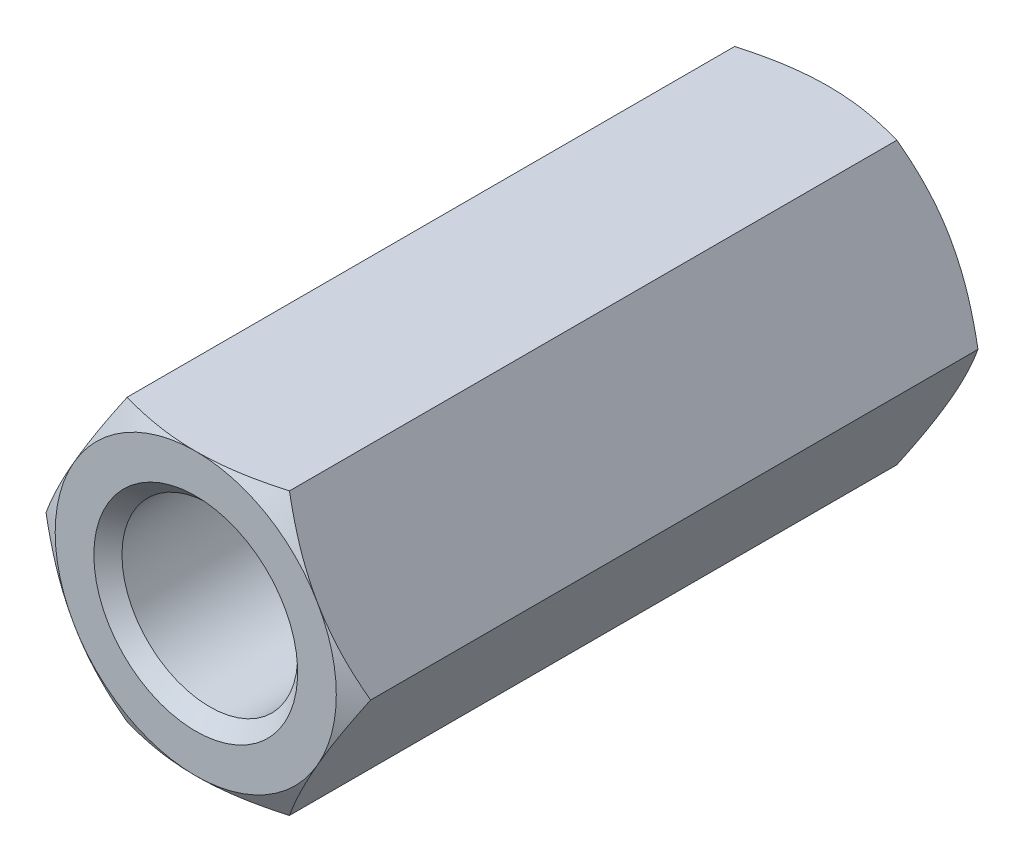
ISO-10303-21;
HEADER;
FILE_DESCRIPTION(('STEP AP214'),'2;1');
FILE_NAME('part.step','',(''),(''),'','','');
FILE_SCHEMA(('AUTOMOTIVE_DESIGN { 1 0 10303 214 1 1 1 1 }'));
ENDSEC;
DATA;
#1=APPLICATION_CONTEXT('core data for automotive mechanical design processes');
#2=APPLICATION_PROTOCOL_DEFINITION('international standard','automotive_design',2000,#1);
#3=PRODUCT_CONTEXT('',#1,'mechanical');
#4=PRODUCT('Part','Part','',(#3));
#5=PRODUCT_RELATED_PRODUCT_CATEGORY('part','',(#4));
#6=PRODUCT_DEFINITION_FORMATION('','',#4);
#7=PRODUCT_DEFINITION_CONTEXT('part definition',#1,'design');
#8=PRODUCT_DEFINITION('design','',#6,#7);
#9=PRODUCT_DEFINITION_SHAPE('','',#8);
#10=(LENGTH_UNIT() NAMED_UNIT(*) SI_UNIT(.MILLI.,.METRE.));
#11=(NAMED_UNIT(*) PLANE_ANGLE_UNIT() SI_UNIT($,.RADIAN.));
#12=(NAMED_UNIT(*) SI_UNIT($,.STERADIAN.) SOLID_ANGLE_UNIT());
#13=UNCERTAINTY_MEASURE_WITH_UNIT(LENGTH_MEASURE(1.E-05),#10,'distance_accuracy_value','');
#14=(GEOMETRIC_REPRESENTATION_CONTEXT(3) GLOBAL_UNCERTAINTY_ASSIGNED_CONTEXT((#13)) GLOBAL_UNIT_ASSIGNED_CONTEXT((#10,
#11,#12)) REPRESENTATION_CONTEXT('',''));
#15=CARTESIAN_POINT('',(0.,0.,0.));
#16=DIRECTION('',(0.,0.,1.));
#17=DIRECTION('',(1.,0.,0.));
#18=AXIS2_PLACEMENT_3D('',#15,#16,#17);
#19=CARTESIAN_POINT('',(4.61880215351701,0.,-9.));
#20=DIRECTION('',(0.866025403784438,0.5,0.));
#21=DIRECTION('',(-0.5,0.866025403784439,0.));
#22=AXIS2_PLACEMENT_3D('',#19,#20,#21);
#23=PLANE('',#22);
#24=CARTESIAN_POINT('',(4.61891762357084,-0.000199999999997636,8.64266774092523));
#25=CARTESIAN_POINT('',(4.5174314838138,0.17557915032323,8.70128212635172));
#26=CARTESIAN_POINT('',(4.41506932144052,0.352875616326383,8.75458967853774));
#27=CARTESIAN_POINT('',(4.20857250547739,0.710538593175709,8.8476383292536));
#28=CARTESIAN_POINT('',(4.10443418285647,0.890911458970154,8.8873465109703));
#29=CARTESIAN_POINT('',(3.89744813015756,1.24942181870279,8.94915778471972));
#30=CARTESIAN_POINT('',(3.79463224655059,1.42750415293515,8.97167226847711));
#31=CARTESIAN_POINT('',(3.58851671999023,1.78450671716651,8.99854937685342));
#32=CARTESIAN_POINT('',(3.48521782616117,1.9634256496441,9.00293425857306));
#33=CARTESIAN_POINT('',(3.29219970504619,2.29774284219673,8.99380992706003));
#34=CARTESIAN_POINT('',(3.20245157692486,2.45319115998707,8.982541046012));
#35=CARTESIAN_POINT('',(3.02354002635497,2.76307505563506,8.94682600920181));
#36=CARTESIAN_POINT('',(2.93437722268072,2.91750956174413,8.92236765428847));
#37=CARTESIAN_POINT('',(2.75509682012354,3.22803232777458,8.86122393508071));
#38=CARTESIAN_POINT('',(2.6650019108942,3.3840812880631,8.82427939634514));
#39=CARTESIAN_POINT('',(2.48615580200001,3.69385183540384,8.74042992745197));
#40=CARTESIAN_POINT('',(2.39740231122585,3.84757739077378,8.69354469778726));
#41=CARTESIAN_POINT('',(2.30928560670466,4.0002,8.64266774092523));
#42=B_SPLINE_CURVE_WITH_KNOTS('',3,(#24,#25,#26,#27,#28,#29,#30,#31,#32,#33,#34,#35,#36,#37,#38,
#39,#40,#41),.UNSPECIFIED.,.F.,.F.,(4,2,2,2,2,2,2,2,4),(0.,0.634047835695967,1.26961969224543,
1.88946157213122,2.50854226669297,3.04757825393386,3.58711366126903,4.13861653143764,
4.68903648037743),.UNSPECIFIED.);
#43=CARTESIAN_POINT('',(4.61880215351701,0.,8.64273441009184));
#44=VERTEX_POINT('',#43);
#45=CARTESIAN_POINT('',(3.46410161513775,2.,9.));
#46=VERTEX_POINT('',#45);
#47=EDGE_CURVE('E127',#44,#46,#42,.T.);
#48=ORIENTED_EDGE('',*,*,#47,.F.);
#49=DIRECTION('',(0.,0.,1.));
#50=VECTOR('',#49,1.);
#51=CARTESIAN_POINT('',(4.61880215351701,0.,-9.));
#52=LINE('',#51,#50);
#53=CARTESIAN_POINT('',(4.61880215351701,0.,-8.64273441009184));
#54=VERTEX_POINT('',#53);
#55=EDGE_CURVE('E540',#54,#44,#52,.T.);
#56=ORIENTED_EDGE('',*,*,#55,.F.);
#57=CARTESIAN_POINT('',(4.61891762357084,-0.000199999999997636,-8.64266774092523));
#58=CARTESIAN_POINT('',(4.5174314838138,0.17557915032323,-8.70128212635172));
#59=CARTESIAN_POINT('',(4.41506932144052,0.352875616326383,-8.75458967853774));
#60=CARTESIAN_POINT('',(4.20857250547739,0.710538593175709,-8.8476383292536));
#61=CARTESIAN_POINT('',(4.10443418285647,0.890911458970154,-8.8873465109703));
#62=CARTESIAN_POINT('',(3.89744813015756,1.24942181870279,-8.94915778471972));
#63=CARTESIAN_POINT('',(3.79463224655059,1.42750415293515,-8.97167226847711));
#64=CARTESIAN_POINT('',(3.58851671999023,1.78450671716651,-8.99854937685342));
#65=CARTESIAN_POINT('',(3.48521782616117,1.9634256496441,-9.00293425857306));
#66=CARTESIAN_POINT('',(3.29219970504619,2.29774284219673,-8.99380992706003));
#67=CARTESIAN_POINT('',(3.20245157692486,2.45319115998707,-8.982541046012));
#68=CARTESIAN_POINT('',(3.02354002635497,2.76307505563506,-8.94682600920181));
#69=CARTESIAN_POINT('',(2.93437722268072,2.91750956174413,-8.92236765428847));
#70=CARTESIAN_POINT('',(2.75509682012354,3.22803232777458,-8.86122393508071));
#71=CARTESIAN_POINT('',(2.6650019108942,3.3840812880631,-8.82427939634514));
#72=CARTESIAN_POINT('',(2.48615580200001,3.69385183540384,-8.74042992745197));
#73=CARTESIAN_POINT('',(2.39740231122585,3.84757739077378,-8.69354469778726));
#74=CARTESIAN_POINT('',(2.30928560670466,4.0002,-8.64266774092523));
#75=B_SPLINE_CURVE_WITH_KNOTS('',3,(#57,#58,#59,#60,#61,#62,#63,#64,#65,#66,#67,#68,#69,#70,#71,
#72,#73,#74),.UNSPECIFIED.,.F.,.F.,(4,2,2,2,2,2,2,2,4),(0.,0.634047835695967,1.26961969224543,
1.88946157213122,2.50854226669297,3.04757825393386,3.58711366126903,4.13861653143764,
4.68903648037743),.UNSPECIFIED.);
#76=CARTESIAN_POINT('',(3.46410161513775,2.,-9.));
#77=VERTEX_POINT('',#76);
#78=EDGE_CURVE('E629',#54,#77,#75,.T.);
#79=ORIENTED_EDGE('',*,*,#78,.T.);
#80=CARTESIAN_POINT('',(2.3094010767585,4.,-8.64273441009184));
#81=VERTEX_POINT('',#80);
#82=EDGE_CURVE('E269',#77,#81,#75,.T.);
#83=ORIENTED_EDGE('',*,*,#82,.T.);
#84=DIRECTION('',(0.,0.,1.));
#85=VECTOR('',#84,1.);
#86=CARTESIAN_POINT('',(2.3094010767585,4.,-9.));
#87=LINE('',#86,#85);
#88=CARTESIAN_POINT('',(2.3094010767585,4.,8.64273441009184));
#89=VERTEX_POINT('',#88);
#90=EDGE_CURVE('E159',#81,#89,#87,.T.);
#91=ORIENTED_EDGE('',*,*,#90,.T.);
#92=EDGE_CURVE('E140',#46,#89,#42,.T.);
#93=ORIENTED_EDGE('',*,*,#92,.F.);
#94=EDGE_LOOP('',(#48,#56,#79,#83,#91,#93));
#95=FACE_BOUND('',#94,.T.);
#96=ADVANCED_FACE('F41',(#95),#23,.T.);
#97=CARTESIAN_POINT('',(2.3094010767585,-4.,-9.));
#98=DIRECTION('',(0.866025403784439,-0.5,0.));
#99=DIRECTION('',(0.5,0.866025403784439,0.));
#100=AXIS2_PLACEMENT_3D('',#97,#98,#99);
#101=PLANE('',#100);
#102=CARTESIAN_POINT('',(2.30928560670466,-4.0002,8.64266774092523));
#103=CARTESIAN_POINT('',(2.4107717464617,-3.82442084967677,8.70128212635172));
#104=CARTESIAN_POINT('',(2.51313390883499,-3.64712438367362,8.75458967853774));
#105=CARTESIAN_POINT('',(2.71963072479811,-3.28946140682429,8.8476383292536));
#106=CARTESIAN_POINT('',(2.82376904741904,-3.10908854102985,8.8873465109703));
#107=CARTESIAN_POINT('',(3.03075510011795,-2.75057818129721,8.94915778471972));
#108=CARTESIAN_POINT('',(3.13357098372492,-2.57249584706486,8.97167226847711));
#109=CARTESIAN_POINT('',(3.33968651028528,-2.21549328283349,8.99854937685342));
#110=CARTESIAN_POINT('',(3.44298540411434,-2.0365743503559,9.00293425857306));
#111=CARTESIAN_POINT('',(3.63600352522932,-1.70225715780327,8.99380992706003));
#112=CARTESIAN_POINT('',(3.72575165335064,-1.54680884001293,8.98254104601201));
#113=CARTESIAN_POINT('',(3.90466320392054,-1.23692494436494,8.94682600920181));
#114=CARTESIAN_POINT('',(3.99382600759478,-1.08249043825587,8.92236765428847));
#115=CARTESIAN_POINT('',(4.17310641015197,-0.771967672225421,8.86122393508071));
#116=CARTESIAN_POINT('',(4.26320131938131,-0.615918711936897,8.82427939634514));
#117=CARTESIAN_POINT('',(4.4420474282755,-0.306148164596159,8.74042992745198));
#118=CARTESIAN_POINT('',(4.53080091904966,-0.152422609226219,8.69354469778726));
#119=CARTESIAN_POINT('',(4.61891762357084,0.00020000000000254,8.64266774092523));
#120=B_SPLINE_CURVE_WITH_KNOTS('',3,(#102,#103,#104,#105,#106,#107,#108,#109,#110,#111,#112,
#113,#114,#115,#116,#117,#118,#119),.UNSPECIFIED.,.F.,.F.,(4,2,2,2,2,2,2,2,4),(0.,
0.634047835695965,1.26961969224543,1.88946157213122,2.50854226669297,3.04757825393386,
3.58711366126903,4.13861653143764,4.68903648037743),.UNSPECIFIED.);
#121=CARTESIAN_POINT('',(2.3094010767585,-4.,8.64273441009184));
#122=VERTEX_POINT('',#121);
#123=CARTESIAN_POINT('',(3.46410161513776,-2.,9.));
#124=VERTEX_POINT('',#123);
#125=EDGE_CURVE('E591',#122,#124,#120,.T.);
#126=ORIENTED_EDGE('',*,*,#125,.F.);
#127=DIRECTION('',(0.,0.,1.));
#128=VECTOR('',#127,1.);
#129=CARTESIAN_POINT('',(2.3094010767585,-4.,-9.));
#130=LINE('',#129,#128);
#131=CARTESIAN_POINT('',(2.3094010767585,-4.,-8.64273441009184));
#132=VERTEX_POINT('',#131);
#133=EDGE_CURVE('E283',#132,#122,#130,.T.);
#134=ORIENTED_EDGE('',*,*,#133,.F.);
#135=CARTESIAN_POINT('',(2.30928560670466,-4.0002,-8.64266774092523));
#136=CARTESIAN_POINT('',(2.4107717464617,-3.82442084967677,-8.70128212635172));
#137=CARTESIAN_POINT('',(2.51313390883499,-3.64712438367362,-8.75458967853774));
#138=CARTESIAN_POINT('',(2.71963072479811,-3.28946140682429,-8.8476383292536));
#139=CARTESIAN_POINT('',(2.82376904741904,-3.10908854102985,-8.8873465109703));
#140=CARTESIAN_POINT('',(3.03075510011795,-2.75057818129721,-8.94915778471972));
#141=CARTESIAN_POINT('',(3.13357098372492,-2.57249584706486,-8.97167226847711));
#142=CARTESIAN_POINT('',(3.33968651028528,-2.21549328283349,-8.99854937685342));
#143=CARTESIAN_POINT('',(3.44298540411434,-2.0365743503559,-9.00293425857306));
#144=CARTESIAN_POINT('',(3.63600352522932,-1.70225715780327,-8.99380992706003));
#145=CARTESIAN_POINT('',(3.72575165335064,-1.54680884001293,-8.98254104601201));
#146=CARTESIAN_POINT('',(3.90466320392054,-1.23692494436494,-8.94682600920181));
#147=CARTESIAN_POINT('',(3.99382600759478,-1.08249043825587,-8.92236765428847));
#148=CARTESIAN_POINT('',(4.17310641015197,-0.771967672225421,-8.86122393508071));
#149=CARTESIAN_POINT('',(4.26320131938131,-0.615918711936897,-8.82427939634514));
#150=CARTESIAN_POINT('',(4.4420474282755,-0.306148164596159,-8.74042992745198));
#151=CARTESIAN_POINT('',(4.53080091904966,-0.152422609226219,-8.69354469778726));
#152=CARTESIAN_POINT('',(4.61891762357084,0.00020000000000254,-8.64266774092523));
#153=B_SPLINE_CURVE_WITH_KNOTS('',3,(#135,#136,#137,#138,#139,#140,#141,#142,#143,#144,#145,
#146,#147,#148,#149,#150,#151,#152),.UNSPECIFIED.,.F.,.F.,(4,2,2,2,2,2,2,2,4),(0.,
0.634047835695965,1.26961969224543,1.88946157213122,2.50854226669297,3.04757825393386,
3.58711366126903,4.13861653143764,4.68903648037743),.UNSPECIFIED.);
#154=CARTESIAN_POINT('',(3.46410161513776,-2.,-9.));
#155=VERTEX_POINT('',#154);
#156=EDGE_CURVE('E555',#132,#155,#153,.T.);
#157=ORIENTED_EDGE('',*,*,#156,.T.);
#158=EDGE_CURVE('E284',#155,#54,#153,.T.);
#159=ORIENTED_EDGE('',*,*,#158,.T.);
#160=ORIENTED_EDGE('',*,*,#55,.T.);
#161=EDGE_CURVE('E132',#124,#44,#120,.T.);
#162=ORIENTED_EDGE('',*,*,#161,.F.);
#163=EDGE_LOOP('',(#126,#134,#157,#159,#160,#162));
#164=FACE_BOUND('',#163,.T.);
#165=ADVANCED_FACE('F254',(#164),#101,.T.);
#166=CARTESIAN_POINT('',(-2.3094010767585,-4.,-9.));
#167=DIRECTION('',(0.,-1.,0.));
#168=DIRECTION('',(0.,0.,-1.));
#169=AXIS2_PLACEMENT_3D('',#166,#167,#168);
#170=PLANE('',#169);
#171=CARTESIAN_POINT('',(-16.4916312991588,-4.,1.51188603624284));
#172=CARTESIAN_POINT('',(-16.1312328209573,-4.,1.71409069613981));
#173=CARTESIAN_POINT('',(-15.77068382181,-4.,1.91602775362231));
#174=CARTESIAN_POINT('',(-15.049201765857,-4.,2.31921881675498));
#175=CARTESIAN_POINT('',(-14.6882687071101,-4.,2.52047281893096));
#176=CARTESIAN_POINT('',(-13.9658537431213,-4.,2.92219537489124));
#177=CARTESIAN_POINT('',(-13.6043717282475,-4.,3.12266373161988));
#178=CARTESIAN_POINT('',(-12.8808313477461,-4.,3.52255625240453));
#179=CARTESIAN_POINT('',(-12.5187729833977,-4.,3.72198041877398));
#180=CARTESIAN_POINT('',(-11.7954183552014,-4.,4.11868585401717));
#181=CARTESIAN_POINT('',(-11.4341250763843,-4.,4.31597256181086));
#182=CARTESIAN_POINT('',(-10.7106137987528,-4.,4.70884244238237));
#183=CARTESIAN_POINT('',(-10.3483958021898,-4.,4.90442561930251));
#184=CARTESIAN_POINT('',(-9.6227924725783,-4.,5.29331429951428));
#185=CARTESIAN_POINT('',(-9.25940728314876,-4.,5.48662007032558));
#186=CARTESIAN_POINT('',(-8.5310232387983,-4.,5.87016008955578));
#187=CARTESIAN_POINT('',(-8.16602440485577,-4.,6.06039437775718));
#188=CARTESIAN_POINT('',(-7.43762903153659,-4.,6.43460741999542));
#189=CARTESIAN_POINT('',(-7.07425550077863,-4.,6.61863073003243));
#190=CARTESIAN_POINT('',(-6.52687320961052,-4.,6.89007104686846));
#191=CARTESIAN_POINT('',(-6.34400823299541,-4.,6.97979355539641));
#192=CARTESIAN_POINT('',(-5.97735992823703,-4.,7.15733986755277));
#193=CARTESIAN_POINT('',(-5.79357661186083,-4.,7.24516369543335));
#194=CARTESIAN_POINT('',(-5.42381455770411,-4.,7.41897809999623));
#195=CARTESIAN_POINT('',(-5.23782926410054,-4.,7.50495476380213));
#196=CARTESIAN_POINT('',(-4.86451206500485,-4.,7.67392578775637));
#197=CARTESIAN_POINT('',(-4.67718020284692,-4.,7.75692024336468));
#198=CARTESIAN_POINT('',(-4.30091095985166,-4.,7.91911298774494));
#199=CARTESIAN_POINT('',(-4.11197386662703,-4.,7.99831194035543));
#200=CARTESIAN_POINT('',(-3.73214185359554,-4.,8.15184400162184));
#201=CARTESIAN_POINT('',(-3.54124707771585,-4.,8.22617746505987));
#202=CARTESIAN_POINT('',(-3.11243143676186,-4.,8.38512278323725));
#203=CARTESIAN_POINT('',(-2.87389730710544,-4.,8.46810545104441));
#204=CARTESIAN_POINT('',(-2.3925623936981,-4.,8.62091075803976));
#205=CARTESIAN_POINT('',(-2.14976124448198,-4.,8.6907322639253));
#206=CARTESIAN_POINT('',(-1.66248200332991,-4.,8.81165231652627));
#207=CARTESIAN_POINT('',(-1.41805966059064,-4.,8.86296698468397));
#208=CARTESIAN_POINT('',(-1.04871773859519,-4.,8.92292392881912));
#209=CARTESIAN_POINT('',(-0.92516224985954,-4.,8.94007304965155));
#210=CARTESIAN_POINT('',(-0.677355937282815,-4.,8.96817129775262));
#211=CARTESIAN_POINT('',(-0.553105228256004,-4.,8.97912141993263));
#212=CARTESIAN_POINT('',(-0.302254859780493,-4.,8.99455291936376));
#213=CARTESIAN_POINT('',(-0.175648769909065,-4.,8.99893082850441));
#214=CARTESIAN_POINT('',(0.0776131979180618,-4.,9.00072237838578));
#215=CARTESIAN_POINT('',(0.204269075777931,-4.,8.99813603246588));
#216=CARTESIAN_POINT('',(0.457267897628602,-4.,8.986099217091));
#217=CARTESIAN_POINT('',(0.583610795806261,-4.,8.97664779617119));
#218=CARTESIAN_POINT('',(0.835635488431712,-4.,8.95123191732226));
#219=CARTESIAN_POINT('',(0.961317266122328,-4.,8.93526729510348));
#220=CARTESIAN_POINT('',(1.21324172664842,-4.,8.89714078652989));
#221=CARTESIAN_POINT('',(1.33947360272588,-4.,8.87490817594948));
#222=CARTESIAN_POINT('',(1.5908473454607,-4.,8.82499230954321));
#223=CARTESIAN_POINT('',(1.71598919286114,-4.,8.79730895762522));
#224=CARTESIAN_POINT('',(1.96515481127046,-4.,8.73717674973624));
#225=CARTESIAN_POINT('',(2.08917822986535,-4.,8.70472644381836));
#226=CARTESIAN_POINT('',(2.33606506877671,-4.,8.63573069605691));
#227=CARTESIAN_POINT('',(2.45892854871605,-4.,8.59918546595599));
#228=CARTESIAN_POINT('',(2.79836139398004,-4.,8.49293320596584));
#229=CARTESIAN_POINT('',(3.0137568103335,-4.,8.4194760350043));
#230=CARTESIAN_POINT('',(3.44159224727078,-4.,8.26435823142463));
#231=CARTESIAN_POINT('',(3.6540314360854,-4.,8.18269534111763));
#232=CARTESIAN_POINT('',(4.07663527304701,-4.,8.01314779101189));
#233=CARTESIAN_POINT('',(4.28679753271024,-4.,7.92525721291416));
#234=CARTESIAN_POINT('',(4.70508199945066,-4.,7.74483049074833));
#235=CARTESIAN_POINT('',(4.91320440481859,-4.,7.65229480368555));
#236=CARTESIAN_POINT('',(5.32837622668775,-4.,7.46339746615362));
#237=CARTESIAN_POINT('',(5.53542124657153,-4.,7.36702618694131));
#238=CARTESIAN_POINT('',(5.94818704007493,-4.,7.17148597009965));
#239=CARTESIAN_POINT('',(6.15390778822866,-4.,7.07231697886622));
#240=CARTESIAN_POINT('',(6.56415611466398,-4.,6.87182573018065));
#241=CARTESIAN_POINT('',(6.76868428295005,-4.,6.77050467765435));
#242=CARTESIAN_POINT('',(7.17685446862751,-4.,6.56609136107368));
#243=CARTESIAN_POINT('',(7.38049647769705,-4.,6.46299908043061));
#244=CARTESIAN_POINT('',(7.99165611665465,-4.,6.15090841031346));
#245=CARTESIAN_POINT('',(8.39807249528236,-4.,5.93975438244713));
#246=CARTESIAN_POINT('',(9.20890655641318,-4.,5.51353970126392));
#247=CARTESIAN_POINT('',(9.61332398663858,-4.,5.29847857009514));
#248=CARTESIAN_POINT('',(10.4200598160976,-4.,4.8659205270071));
#249=CARTESIAN_POINT('',(10.8223804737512,-4.,4.64842782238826));
#250=CARTESIAN_POINT('',(11.6259229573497,-4.,4.21142176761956));
#251=CARTESIAN_POINT('',(12.0271447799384,-4.,3.9919084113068));
#252=CARTESIAN_POINT('',(12.7683222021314,-4.,3.58456647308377));
#253=CARTESIAN_POINT('',(13.108394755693,-4.,3.3969505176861));
#254=CARTESIAN_POINT('',(13.7881624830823,-4.,3.02077357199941));
#255=CARTESIAN_POINT('',(14.1278574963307,-4.,2.83221229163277));
#256=CARTESIAN_POINT('',(14.8051403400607,-4.,2.45532366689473));
#257=CARTESIAN_POINT('',(15.142730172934,-4.,2.26699991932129));
#258=CARTESIAN_POINT('',(15.8174678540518,-4.,1.88982453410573));
#259=CARTESIAN_POINT('',(16.154615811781,-4.,1.70097309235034));
#260=CARTESIAN_POINT('',(16.4916312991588,-4.,1.51188603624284));
#261=B_SPLINE_CURVE_WITH_KNOTS('',3,(#171,#172,#173,#174,#175,#176,#177,#178,#179,#180,#181,
#182,#183,#184,#185,#186,#187,#188,#189,#190,#191,#192,#193,#194,#195,#196,#197,#198,#199,#200,
#201,#202,#203,#204,#205,#206,#207,#208,#209,#210,#211,#212,#213,#214,#215,#216,#217,#218,#219,
#220,#221,#222,#223,#224,#225,#226,#227,#228,#229,#230,#231,#232,#233,#234,#235,#236,#237,#238,
#239,#240,#241,#242,#243,#244,#245,#246,#247,#248,#249,#250,#251,#252,#253,#254,#255,#256,#257,
#258,#259,#260),.UNSPECIFIED.,.F.,.F.,(4,2,2,2,2,2,2,2,2,2,2,2,2,2,2,2,2,2,2,2,2,2,2,2,2,2,2,2,
2,2,2,2,2,2,2,2,2,2,2,2,2,2,2,2,4),(0.,1.23974393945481,2.47949417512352,3.71953766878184,
4.95957841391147,6.19452184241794,7.42946226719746,8.66425615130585,9.89903402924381,
11.1209302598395,11.7319927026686,12.343047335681,12.9577156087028,13.5723641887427,
14.1869048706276,14.8014006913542,15.5587851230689,16.3162347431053,17.0645282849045,
17.4386158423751,17.8126433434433,18.1924996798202,18.5723552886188,18.9522635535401,
19.3321814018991,19.7165704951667,20.100966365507,20.4854793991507,20.8699725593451,
21.5524524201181,22.2351205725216,22.9184464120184,23.601705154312,24.2868031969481,
24.9719143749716,25.6566515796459,26.3413952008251,27.7153469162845,29.0894678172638,
30.4614964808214,31.8335293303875,32.9987066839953,34.164266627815,35.3239618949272,
36.4832723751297),.UNSPECIFIED.);
#262=CARTESIAN_POINT('',(-2.3094010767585,-4.,8.64273441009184));
#263=VERTEX_POINT('',#262);
#264=CARTESIAN_POINT('',(0.,-4.,9.));
#265=VERTEX_POINT('',#264);
#266=EDGE_CURVE('E593',#263,#265,#261,.T.);
#267=ORIENTED_EDGE('',*,*,#266,.F.);
#268=DIRECTION('',(0.,0.,1.));
#269=VECTOR('',#268,1.);
#270=CARTESIAN_POINT('',(-2.3094010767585,-4.,-9.));
#271=LINE('',#270,#269);
#272=CARTESIAN_POINT('',(-2.3094010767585,-4.,-8.64273441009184));
#273=VERTEX_POINT('',#272);
#274=EDGE_CURVE('E541',#273,#263,#271,.T.);
#275=ORIENTED_EDGE('',*,*,#274,.F.);
#276=CARTESIAN_POINT('',(-10.9193914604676,-4.,-4.59540798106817));
#277=CARTESIAN_POINT('',(-10.6754464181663,-4.,-4.72764470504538));
#278=CARTESIAN_POINT('',(-10.4312897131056,-4.,-4.85949298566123));
#279=CARTESIAN_POINT('',(-9.94244275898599,-4.,-5.12220803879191));
#280=CARTESIAN_POINT('',(-9.69775249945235,-4.,-5.25307479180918));
#281=CARTESIAN_POINT('',(-9.20754604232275,-4.,-5.51371891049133));
#282=CARTESIAN_POINT('',(-8.96202934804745,-4.,-5.64349534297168));
#283=CARTESIAN_POINT('',(-8.47021923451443,-4.,-5.90156473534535));
#284=CARTESIAN_POINT('',(-8.22392582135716,-4.,-6.02985770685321));
#285=CARTESIAN_POINT('',(-7.72178617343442,-4.,-6.2890137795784));
#286=CARTESIAN_POINT('',(-7.46590583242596,-4.,-6.41981090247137));
#287=CARTESIAN_POINT('',(-6.95284589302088,-4.,-6.67883016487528));
#288=CARTESIAN_POINT('',(-6.69566630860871,-4.,-6.80705233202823));
#289=CARTESIAN_POINT('',(-6.17972310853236,-4.,-7.06007088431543));
#290=CARTESIAN_POINT('',(-5.92096001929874,-4.,-7.18486833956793));
#291=CARTESIAN_POINT('',(-5.40129143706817,-4.,-7.42990611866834));
#292=CARTESIAN_POINT('',(-5.14038604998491,-4.,-7.55014666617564));
#293=CARTESIAN_POINT('',(-4.60388312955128,-4.,-7.78967391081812));
#294=CARTESIAN_POINT('',(-4.32815528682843,-4.,-7.9086708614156));
#295=CARTESIAN_POINT('',(-3.77255113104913,-4.,-8.13691684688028));
#296=CARTESIAN_POINT('',(-3.4926736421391,-4.,-8.24616305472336));
#297=CARTESIAN_POINT('',(-2.93037800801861,-4.,-8.44936328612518));
#298=CARTESIAN_POINT('',(-2.64801025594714,-4.,-8.54345439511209));
#299=CARTESIAN_POINT('',(-2.07717481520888,-4.,-8.71104060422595));
#300=CARTESIAN_POINT('',(-1.78871049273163,-4.,-8.78454676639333));
#301=CARTESIAN_POINT('',(-1.27903400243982,-4.,-8.88766736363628));
#302=CARTESIAN_POINT('',(-1.05915292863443,-4.,-8.92367104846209));
#303=CARTESIAN_POINT('',(-0.727634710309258,-4.,-8.96293564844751));
#304=CARTESIAN_POINT('',(-0.616850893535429,-4.,-8.97356688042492));
#305=CARTESIAN_POINT('',(-0.394912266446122,-4.,-8.98964133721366));
#306=CARTESIAN_POINT('',(-0.283757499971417,-4.,-8.99508515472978));
#307=CARTESIAN_POINT('',(-0.0614106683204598,-4.,-9.00061771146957));
#308=CARTESIAN_POINT('',(0.0497812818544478,-4.,-9.00071106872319));
#309=CARTESIAN_POINT('',(0.272039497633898,-4.,-8.99555323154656));
#310=CARTESIAN_POINT('',(0.383105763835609,-4.,-8.99030206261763));
#311=CARTESIAN_POINT('',(0.604876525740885,-4.,-8.97460892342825));
#312=CARTESIAN_POINT('',(0.715580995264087,-4.,-8.96416658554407));
#313=CARTESIAN_POINT('',(0.936422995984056,-4.,-8.93838291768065));
#314=CARTESIAN_POINT('',(1.04656045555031,-4.,-8.923040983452));
#315=CARTESIAN_POINT('',(1.36926182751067,-4.,-8.87129492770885));
#316=CARTESIAN_POINT('',(1.58083772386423,-4.,-8.8286448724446));
#317=CARTESIAN_POINT('',(2.00076058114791,-4.,-8.72959584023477));
#318=CARTESIAN_POINT('',(2.20910578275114,-4.,-8.67318963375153));
#319=CARTESIAN_POINT('',(2.62305814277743,-4.,-8.54963228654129));
#320=CARTESIAN_POINT('',(2.82865801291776,-4.,-8.48245704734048));
#321=CARTESIAN_POINT('',(3.2369703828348,-4.,-8.34002880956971));
#322=CARTESIAN_POINT('',(3.43968332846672,-4.,-8.26477707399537));
#323=CARTESIAN_POINT('',(3.84636914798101,-4.,-8.10671756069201));
#324=CARTESIAN_POINT('',(4.05029799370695,-4.,-8.0237973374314));
#325=CARTESIAN_POINT('',(4.4561142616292,-4.,-7.85311958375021));
#326=CARTESIAN_POINT('',(4.65800164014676,-4.,-7.76536195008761));
#327=CARTESIAN_POINT('',(5.05984603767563,-4.,-7.58624075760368));
#328=CARTESIAN_POINT('',(5.25980524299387,-4.,-7.49488208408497));
#329=CARTESIAN_POINT('',(5.65836621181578,-4.,-7.30926571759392));
#330=CARTESIAN_POINT('',(5.85696799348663,-4.,-7.21500806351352));
#331=CARTESIAN_POINT('',(6.2643782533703,-4.,-7.01874796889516));
#332=CARTESIAN_POINT('',(6.47312165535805,-4.,-6.91661070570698));
#333=CARTESIAN_POINT('',(6.88960080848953,-4.,-6.71029969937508));
#334=CARTESIAN_POINT('',(7.09733654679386,-4.,-6.60612593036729));
#335=CARTESIAN_POINT('',(7.7194602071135,-4.,-6.29109737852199));
#336=CARTESIAN_POINT('',(8.13261474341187,-4.,-6.07780829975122));
#337=CARTESIAN_POINT('',(8.94226579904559,-4.,-5.65443497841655));
#338=CARTESIAN_POINT('',(9.33884019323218,-4.,-5.44449892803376));
#339=CARTESIAN_POINT('',(9.93245419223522,-4.,-5.12749109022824));
#340=CARTESIAN_POINT('',(10.1300702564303,-4.,-5.02149690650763));
#341=CARTESIAN_POINT('',(10.5249683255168,-4.,-4.80889097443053));
#342=CARTESIAN_POINT('',(10.722250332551,-4.,-4.70227923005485));
#343=CARTESIAN_POINT('',(10.9193914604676,-4.,-4.59540798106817));
#344=B_SPLINE_CURVE_WITH_KNOTS('',3,(#276,#277,#278,#279,#280,#281,#282,#283,#284,#285,#286,
#287,#288,#289,#290,#291,#292,#293,#294,#295,#296,#297,#298,#299,#300,#301,#302,#303,#304,#305,
#306,#307,#308,#309,#310,#311,#312,#313,#314,#315,#316,#317,#318,#319,#320,#321,#322,#323,#324,
#325,#326,#327,#328,#329,#330,#331,#332,#333,#334,#335,#336,#337,#338,#339,#340,#341,#342,#343),
.UNSPECIFIED.,.F.,.F.,(4,2,2,2,2,2,2,2,2,2,2,2,2,2,2,2,2,2,2,2,2,2,2,2,2,2,2,2,2,2,2,2,2,4),(0.,
0.832444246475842,1.66490498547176,2.49801751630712,3.33112351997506,4.19322828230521,
5.05532378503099,5.91714676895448,6.77892739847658,7.67973160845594,8.58079614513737,
9.47318665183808,10.3650966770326,11.032702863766,11.3664759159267,11.7002108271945,
12.033657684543,12.3671029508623,12.7005718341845,13.0340818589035,13.6809363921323,
14.3281316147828,14.9767958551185,15.6253588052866,16.2857056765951,16.9460666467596,
17.6055606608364,18.2650458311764,18.96220638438,19.6593757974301,21.0542144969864,
22.4003431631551,23.0730842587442,23.7458210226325),.UNSPECIFIED.);
#345=CARTESIAN_POINT('',(0.,-4.,-9.));
#346=VERTEX_POINT('',#345);
#347=EDGE_CURVE('E527',#273,#346,#344,.T.);
#348=ORIENTED_EDGE('',*,*,#347,.T.);
#349=EDGE_CURVE('E259',#346,#132,#344,.T.);
#350=ORIENTED_EDGE('',*,*,#349,.T.);
#351=ORIENTED_EDGE('',*,*,#133,.T.);
#352=EDGE_CURVE('E138',#265,#122,#261,.T.);
#353=ORIENTED_EDGE('',*,*,#352,.F.);
#354=EDGE_LOOP('',(#267,#275,#348,#350,#351,#353));
#355=FACE_BOUND('',#354,.T.);
#356=ADVANCED_FACE('F292',(#355),#170,.T.);
#357=CARTESIAN_POINT('',(-4.61880215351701,0.,-9.));
#358=DIRECTION('',(-0.866025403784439,-0.5,0.));
#359=DIRECTION('',(0.5,-0.866025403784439,0.));
#360=AXIS2_PLACEMENT_3D('',#357,#358,#359);
#361=PLANE('',#360);
#362=CARTESIAN_POINT('',(-4.61891762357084,0.000199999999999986,8.64266774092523));
#363=CARTESIAN_POINT('',(-4.51743148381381,-0.175579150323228,8.70128212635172));
#364=CARTESIAN_POINT('',(-4.41506932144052,-0.352875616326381,8.75458967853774));
#365=CARTESIAN_POINT('',(-4.20857250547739,-0.710538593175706,8.8476383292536));
#366=CARTESIAN_POINT('',(-4.10443418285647,-0.890911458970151,8.8873465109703));
#367=CARTESIAN_POINT('',(-3.89744813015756,-1.24942181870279,8.94915778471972));
#368=CARTESIAN_POINT('',(-3.79463224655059,-1.42750415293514,8.97167226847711));
#369=CARTESIAN_POINT('',(-3.58851671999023,-1.78450671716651,8.99854937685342));
#370=CARTESIAN_POINT('',(-3.48521782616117,-1.9634256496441,9.00293425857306));
#371=CARTESIAN_POINT('',(-3.29219970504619,-2.29774284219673,8.99380992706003));
#372=CARTESIAN_POINT('',(-3.20245157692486,-2.45319115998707,8.98254104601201));
#373=CARTESIAN_POINT('',(-3.02354002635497,-2.76307505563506,8.94682600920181));
#374=CARTESIAN_POINT('',(-2.93437722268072,-2.91750956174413,8.92236765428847));
#375=CARTESIAN_POINT('',(-2.75509682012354,-3.22803232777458,8.86122393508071));
#376=CARTESIAN_POINT('',(-2.6650019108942,-3.3840812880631,8.82427939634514));
#377=CARTESIAN_POINT('',(-2.48615580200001,-3.69385183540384,8.74042992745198));
#378=CARTESIAN_POINT('',(-2.39740231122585,-3.84757739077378,8.69354469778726));
#379=CARTESIAN_POINT('',(-2.30928560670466,-4.0002,8.64266774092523));
#380=B_SPLINE_CURVE_WITH_KNOTS('',3,(#362,#363,#364,#365,#366,#367,#368,#369,#370,#371,#372,
#373,#374,#375,#376,#377,#378,#379),.UNSPECIFIED.,.F.,.F.,(4,2,2,2,2,2,2,2,4),(0.,
0.634047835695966,1.26961969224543,1.88946157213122,2.50854226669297,3.04757825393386,
3.58711366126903,4.13861653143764,4.68903648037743),.UNSPECIFIED.);
#381=CARTESIAN_POINT('',(-4.61880215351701,0.,8.64273441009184));
#382=VERTEX_POINT('',#381);
#383=CARTESIAN_POINT('',(-3.46410161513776,-2.,9.));
#384=VERTEX_POINT('',#383);
#385=EDGE_CURVE('E176',#382,#384,#380,.T.);
#386=ORIENTED_EDGE('',*,*,#385,.F.);
#387=DIRECTION('',(0.,0.,1.));
#388=VECTOR('',#387,1.);
#389=CARTESIAN_POINT('',(-4.61880215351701,0.,-9.));
#390=LINE('',#389,#388);
#391=CARTESIAN_POINT('',(-4.61880215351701,0.,-8.64273441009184));
#392=VERTEX_POINT('',#391);
#393=EDGE_CURVE('E545',#392,#382,#390,.T.);
#394=ORIENTED_EDGE('',*,*,#393,.F.);
#395=CARTESIAN_POINT('',(-4.61891762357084,0.000199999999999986,-8.64266774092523));
#396=CARTESIAN_POINT('',(-4.51743148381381,-0.175579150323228,-8.70128212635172));
#397=CARTESIAN_POINT('',(-4.41506932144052,-0.352875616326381,-8.75458967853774));
#398=CARTESIAN_POINT('',(-4.20857250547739,-0.710538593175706,-8.8476383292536));
#399=CARTESIAN_POINT('',(-4.10443418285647,-0.890911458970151,-8.8873465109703));
#400=CARTESIAN_POINT('',(-3.89744813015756,-1.24942181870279,-8.94915778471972));
#401=CARTESIAN_POINT('',(-3.79463224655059,-1.42750415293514,-8.97167226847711));
#402=CARTESIAN_POINT('',(-3.58851671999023,-1.78450671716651,-8.99854937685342));
#403=CARTESIAN_POINT('',(-3.48521782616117,-1.9634256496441,-9.00293425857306));
#404=CARTESIAN_POINT('',(-3.29219970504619,-2.29774284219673,-8.99380992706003));
#405=CARTESIAN_POINT('',(-3.20245157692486,-2.45319115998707,-8.98254104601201));
#406=CARTESIAN_POINT('',(-3.02354002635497,-2.76307505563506,-8.94682600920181));
#407=CARTESIAN_POINT('',(-2.93437722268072,-2.91750956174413,-8.92236765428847));
#408=CARTESIAN_POINT('',(-2.75509682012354,-3.22803232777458,-8.86122393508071));
#409=CARTESIAN_POINT('',(-2.6650019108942,-3.3840812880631,-8.82427939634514));
#410=CARTESIAN_POINT('',(-2.48615580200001,-3.69385183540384,-8.74042992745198));
#411=CARTESIAN_POINT('',(-2.39740231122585,-3.84757739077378,-8.69354469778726));
#412=CARTESIAN_POINT('',(-2.30928560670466,-4.0002,-8.64266774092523));
#413=B_SPLINE_CURVE_WITH_KNOTS('',3,(#395,#396,#397,#398,#399,#400,#401,#402,#403,#404,#405,
#406,#407,#408,#409,#410,#411,#412),.UNSPECIFIED.,.F.,.F.,(4,2,2,2,2,2,2,2,4),(0.,
0.634047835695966,1.26961969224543,1.88946157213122,2.50854226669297,3.04757825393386,
3.58711366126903,4.13861653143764,4.68903648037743),.UNSPECIFIED.);
#414=CARTESIAN_POINT('',(-3.46410161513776,-2.,-9.));
#415=VERTEX_POINT('',#414);
#416=EDGE_CURVE('E275',#392,#415,#413,.T.);
#417=ORIENTED_EDGE('',*,*,#416,.T.);
#418=EDGE_CURVE('E282',#415,#273,#413,.T.);
#419=ORIENTED_EDGE('',*,*,#418,.T.);
#420=ORIENTED_EDGE('',*,*,#274,.T.);
#421=EDGE_CURVE('E596',#384,#263,#380,.T.);
#422=ORIENTED_EDGE('',*,*,#421,.F.);
#423=EDGE_LOOP('',(#386,#394,#417,#419,#420,#422));
#424=FACE_BOUND('',#423,.T.);
#425=ADVANCED_FACE('F289',(#424),#361,.T.);
#426=CARTESIAN_POINT('',(-2.3094010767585,4.,-9.));
#427=DIRECTION('',(-0.866025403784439,0.5,0.));
#428=DIRECTION('',(-0.5,-0.866025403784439,0.));
#429=AXIS2_PLACEMENT_3D('',#426,#427,#428);
#430=PLANE('',#429);
#431=CARTESIAN_POINT('',(-2.30928560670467,4.0002,8.64266774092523));
#432=CARTESIAN_POINT('',(-2.41077174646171,3.82442084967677,8.70128212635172));
#433=CARTESIAN_POINT('',(-2.513133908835,3.64712438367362,8.75458967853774));
#434=CARTESIAN_POINT('',(-2.71963072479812,3.28946140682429,8.8476383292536));
#435=CARTESIAN_POINT('',(-2.82376904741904,3.10908854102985,8.8873465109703));
#436=CARTESIAN_POINT('',(-3.03075510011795,2.75057818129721,8.94915778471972));
#437=CARTESIAN_POINT('',(-3.13357098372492,2.57249584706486,8.97167226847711));
#438=CARTESIAN_POINT('',(-3.33968651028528,2.21549328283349,8.99854937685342));
#439=CARTESIAN_POINT('',(-3.44298540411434,2.0365743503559,9.00293425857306));
#440=CARTESIAN_POINT('',(-3.63600352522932,1.70225715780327,8.99380992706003));
#441=CARTESIAN_POINT('',(-3.72575165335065,1.54680884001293,8.982541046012));
#442=CARTESIAN_POINT('',(-3.90466320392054,1.23692494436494,8.94682600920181));
#443=CARTESIAN_POINT('',(-3.99382600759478,1.08249043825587,8.92236765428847));
#444=CARTESIAN_POINT('',(-4.17310641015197,0.771967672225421,8.86122393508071));
#445=CARTESIAN_POINT('',(-4.26320131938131,0.615918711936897,8.82427939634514));
#446=CARTESIAN_POINT('',(-4.4420474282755,0.30614816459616,8.74042992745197));
#447=CARTESIAN_POINT('',(-4.53080091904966,0.15242260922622,8.69354469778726));
#448=CARTESIAN_POINT('',(-4.61891762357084,-0.000200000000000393,8.64266774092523));
#449=B_SPLINE_CURVE_WITH_KNOTS('',3,(#431,#432,#433,#434,#435,#436,#437,#438,#439,#440,#441,
#442,#443,#444,#445,#446,#447,#448),.UNSPECIFIED.,.F.,.F.,(4,2,2,2,2,2,2,2,4),(0.,
0.634047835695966,1.26961969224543,1.88946157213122,2.50854226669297,3.04757825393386,
3.58711366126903,4.13861653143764,4.68903648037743),.UNSPECIFIED.);
#450=CARTESIAN_POINT('',(-2.30940107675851,4.,8.64273441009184));
#451=VERTEX_POINT('',#450);
#452=CARTESIAN_POINT('',(-3.46410161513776,2.,9.));
#453=VERTEX_POINT('',#452);
#454=EDGE_CURVE('E183',#451,#453,#449,.T.);
#455=ORIENTED_EDGE('',*,*,#454,.F.);
#456=DIRECTION('',(0.,0.,1.));
#457=VECTOR('',#456,1.);
#458=CARTESIAN_POINT('',(-2.3094010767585,4.,-9.));
#459=LINE('',#458,#457);
#460=CARTESIAN_POINT('',(-2.3094010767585,4.,-8.64273441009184));
#461=VERTEX_POINT('',#460);
#462=EDGE_CURVE('E233',#461,#451,#459,.T.);
#463=ORIENTED_EDGE('',*,*,#462,.F.);
#464=CARTESIAN_POINT('',(-2.30928560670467,4.0002,-8.64266774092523));
#465=CARTESIAN_POINT('',(-2.41077174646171,3.82442084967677,-8.70128212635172));
#466=CARTESIAN_POINT('',(-2.513133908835,3.64712438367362,-8.75458967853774));
#467=CARTESIAN_POINT('',(-2.71963072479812,3.28946140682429,-8.8476383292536));
#468=CARTESIAN_POINT('',(-2.82376904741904,3.10908854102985,-8.8873465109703));
#469=CARTESIAN_POINT('',(-3.03075510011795,2.75057818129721,-8.94915778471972));
#470=CARTESIAN_POINT('',(-3.13357098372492,2.57249584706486,-8.97167226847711));
#471=CARTESIAN_POINT('',(-3.33968651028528,2.21549328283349,-8.99854937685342));
#472=CARTESIAN_POINT('',(-3.44298540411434,2.0365743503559,-9.00293425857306));
#473=CARTESIAN_POINT('',(-3.63600352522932,1.70225715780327,-8.99380992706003));
#474=CARTESIAN_POINT('',(-3.72575165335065,1.54680884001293,-8.982541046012));
#475=CARTESIAN_POINT('',(-3.90466320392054,1.23692494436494,-8.94682600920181));
#476=CARTESIAN_POINT('',(-3.99382600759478,1.08249043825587,-8.92236765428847));
#477=CARTESIAN_POINT('',(-4.17310641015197,0.771967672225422,-8.86122393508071));
#478=CARTESIAN_POINT('',(-4.26320131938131,0.615918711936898,-8.82427939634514));
#479=CARTESIAN_POINT('',(-4.4420474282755,0.306148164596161,-8.74042992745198));
#480=CARTESIAN_POINT('',(-4.53080091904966,0.152422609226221,-8.69354469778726));
#481=CARTESIAN_POINT('',(-4.61891762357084,-0.000199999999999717,-8.64266774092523));
#482=B_SPLINE_CURVE_WITH_KNOTS('',3,(#464,#465,#466,#467,#468,#469,#470,#471,#472,#473,#474,
#475,#476,#477,#478,#479,#480,#481),.UNSPECIFIED.,.F.,.F.,(4,2,2,2,2,2,2,2,4),(0.,
0.634047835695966,1.26961969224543,1.88946157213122,2.50854226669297,3.04757825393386,
3.58711366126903,4.13861653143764,4.68903648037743),.UNSPECIFIED.);
#483=CARTESIAN_POINT('',(-3.46410161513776,2.,-9.));
#484=VERTEX_POINT('',#483);
#485=EDGE_CURVE('E237',#461,#484,#482,.T.);
#486=ORIENTED_EDGE('',*,*,#485,.T.);
#487=EDGE_CURVE('E549',#484,#392,#482,.T.);
#488=ORIENTED_EDGE('',*,*,#487,.T.);
#489=ORIENTED_EDGE('',*,*,#393,.T.);
#490=EDGE_CURVE('E612',#453,#382,#449,.T.);
#491=ORIENTED_EDGE('',*,*,#490,.F.);
#492=EDGE_LOOP('',(#455,#463,#486,#488,#489,#491));
#493=FACE_BOUND('',#492,.T.);
#494=ADVANCED_FACE('F218',(#493),#430,.T.);
#495=CARTESIAN_POINT('',(2.3094010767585,4.,-9.));
#496=DIRECTION('',(0.,1.,0.));
#497=DIRECTION('',(0.,0.,1.));
#498=AXIS2_PLACEMENT_3D('',#495,#496,#497);
#499=PLANE('',#498);
#500=CARTESIAN_POINT('',(16.4916312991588,4.,1.51188603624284));
#501=CARTESIAN_POINT('',(16.1312328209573,4.,1.71409069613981));
#502=CARTESIAN_POINT('',(15.77068382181,4.,1.91602775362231));
#503=CARTESIAN_POINT('',(15.049201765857,4.,2.31921881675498));
#504=CARTESIAN_POINT('',(14.6882687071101,4.,2.52047281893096));
#505=CARTESIAN_POINT('',(13.9658537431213,4.,2.92219537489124));
#506=CARTESIAN_POINT('',(13.6043717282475,4.,3.12266373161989));
#507=CARTESIAN_POINT('',(12.8808313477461,4.,3.52255625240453));
#508=CARTESIAN_POINT('',(12.5187729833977,4.,3.72198041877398));
#509=CARTESIAN_POINT('',(11.7954183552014,4.,4.11868585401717));
#510=CARTESIAN_POINT('',(11.4341250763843,4.,4.31597256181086));
#511=CARTESIAN_POINT('',(10.7106137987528,4.,4.70884244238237));
#512=CARTESIAN_POINT('',(10.3483958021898,4.,4.90442561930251));
#513=CARTESIAN_POINT('',(9.6227924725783,4.,5.29331429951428));
#514=CARTESIAN_POINT('',(9.25940728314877,4.,5.48662007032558));
#515=CARTESIAN_POINT('',(8.5310232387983,4.,5.87016008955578));
#516=CARTESIAN_POINT('',(8.16602440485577,4.,6.06039437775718));
#517=CARTESIAN_POINT('',(7.43762903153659,4.,6.43460741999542));
#518=CARTESIAN_POINT('',(7.07425550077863,4.,6.61863073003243));
#519=CARTESIAN_POINT('',(6.52687320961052,4.,6.89007104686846));
#520=CARTESIAN_POINT('',(6.34400823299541,4.,6.97979355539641));
#521=CARTESIAN_POINT('',(5.97735992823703,4.,7.15733986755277));
#522=CARTESIAN_POINT('',(5.79357661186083,4.,7.24516369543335));
#523=CARTESIAN_POINT('',(5.42381455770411,4.,7.41897809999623));
#524=CARTESIAN_POINT('',(5.23782926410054,4.,7.50495476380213));
#525=CARTESIAN_POINT('',(4.86451206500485,4.,7.67392578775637));
#526=CARTESIAN_POINT('',(4.67718020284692,4.,7.75692024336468));
#527=CARTESIAN_POINT('',(4.30091095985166,4.,7.91911298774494));
#528=CARTESIAN_POINT('',(4.11197386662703,4.,7.99831194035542));
#529=CARTESIAN_POINT('',(3.73214185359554,4.,8.15184400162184));
#530=CARTESIAN_POINT('',(3.54124707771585,4.,8.22617746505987));
#531=CARTESIAN_POINT('',(3.11243143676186,4.,8.38512278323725));
#532=CARTESIAN_POINT('',(2.87389730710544,4.,8.46810545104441));
#533=CARTESIAN_POINT('',(2.3925623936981,4.,8.62091075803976));
#534=CARTESIAN_POINT('',(2.14976124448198,4.,8.6907322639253));
#535=CARTESIAN_POINT('',(1.66248200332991,4.,8.81165231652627));
#536=CARTESIAN_POINT('',(1.41805966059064,4.,8.86296698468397));
#537=CARTESIAN_POINT('',(1.04871773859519,4.,8.92292392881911));
#538=CARTESIAN_POINT('',(0.925162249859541,4.,8.94007304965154));
#539=CARTESIAN_POINT('',(0.677355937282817,4.,8.96817129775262));
#540=CARTESIAN_POINT('',(0.553105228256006,4.,8.97912141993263));
#541=CARTESIAN_POINT('',(0.302254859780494,4.,8.99455291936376));
#542=CARTESIAN_POINT('',(0.175648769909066,4.,8.99893082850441));
#543=CARTESIAN_POINT('',(-0.0776131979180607,4.,9.00072237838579));
#544=CARTESIAN_POINT('',(-0.20426907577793,4.,8.99813603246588));
#545=CARTESIAN_POINT('',(-0.457267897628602,4.,8.986099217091));
#546=CARTESIAN_POINT('',(-0.583610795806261,4.,8.97664779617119));
#547=CARTESIAN_POINT('',(-0.835635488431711,4.,8.95123191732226));
#548=CARTESIAN_POINT('',(-0.961317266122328,4.,8.93526729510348));
#549=CARTESIAN_POINT('',(-1.21324172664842,4.,8.89714078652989));
#550=CARTESIAN_POINT('',(-1.33947360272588,4.,8.87490817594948));
#551=CARTESIAN_POINT('',(-1.59084734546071,4.,8.8249923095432));
#552=CARTESIAN_POINT('',(-1.71598919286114,4.,8.79730895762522));
#553=CARTESIAN_POINT('',(-1.96515481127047,4.,8.73717674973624));
#554=CARTESIAN_POINT('',(-2.08917822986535,4.,8.70472644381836));
#555=CARTESIAN_POINT('',(-2.33606506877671,4.,8.63573069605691));
#556=CARTESIAN_POINT('',(-2.45892854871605,4.,8.59918546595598));
#557=CARTESIAN_POINT('',(-2.79836139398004,4.,8.49293320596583));
#558=CARTESIAN_POINT('',(-3.0137568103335,4.,8.4194760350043));
#559=CARTESIAN_POINT('',(-3.44159224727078,4.,8.26435823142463));
#560=CARTESIAN_POINT('',(-3.6540314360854,4.,8.18269534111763));
#561=CARTESIAN_POINT('',(-4.07663527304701,4.,8.01314779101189));
#562=CARTESIAN_POINT('',(-4.28679753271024,4.,7.92525721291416));
#563=CARTESIAN_POINT('',(-4.70508199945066,4.,7.74483049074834));
#564=CARTESIAN_POINT('',(-4.91320440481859,4.,7.65229480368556));
#565=CARTESIAN_POINT('',(-5.32837622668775,4.,7.46339746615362));
#566=CARTESIAN_POINT('',(-5.53542124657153,4.,7.36702618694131));
#567=CARTESIAN_POINT('',(-5.94818704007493,4.,7.17148597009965));
#568=CARTESIAN_POINT('',(-6.15390778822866,4.,7.07231697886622));
#569=CARTESIAN_POINT('',(-6.56415611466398,4.,6.87182573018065));
#570=CARTESIAN_POINT('',(-6.76868428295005,4.,6.77050467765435));
#571=CARTESIAN_POINT('',(-7.17685446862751,4.,6.56609136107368));
#572=CARTESIAN_POINT('',(-7.38049647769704,4.,6.46299908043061));
#573=CARTESIAN_POINT('',(-7.99165611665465,4.,6.15090841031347));
#574=CARTESIAN_POINT('',(-8.39807249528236,4.,5.93975438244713));
#575=CARTESIAN_POINT('',(-9.20890655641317,4.,5.51353970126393));
#576=CARTESIAN_POINT('',(-9.61332398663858,4.,5.29847857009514));
#577=CARTESIAN_POINT('',(-10.4200598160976,4.,4.86592052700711));
#578=CARTESIAN_POINT('',(-10.8223804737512,4.,4.64842782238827));
#579=CARTESIAN_POINT('',(-11.6259229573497,4.,4.21142176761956));
#580=CARTESIAN_POINT('',(-12.0271447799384,4.,3.9919084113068));
#581=CARTESIAN_POINT('',(-12.7683222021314,4.,3.58456647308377));
#582=CARTESIAN_POINT('',(-13.108394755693,4.,3.3969505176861));
#583=CARTESIAN_POINT('',(-13.7881624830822,4.,3.02077357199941));
#584=CARTESIAN_POINT('',(-14.1278574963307,4.,2.83221229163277));
#585=CARTESIAN_POINT('',(-14.8051403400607,4.,2.45532366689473));
#586=CARTESIAN_POINT('',(-15.142730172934,4.,2.26699991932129));
#587=CARTESIAN_POINT('',(-15.8174678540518,4.,1.88982453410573));
#588=CARTESIAN_POINT('',(-16.154615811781,4.,1.70097309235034));
#589=CARTESIAN_POINT('',(-16.4916312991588,4.,1.51188603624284));
#590=B_SPLINE_CURVE_WITH_KNOTS('',3,(#500,#501,#502,#503,#504,#505,#506,#507,#508,#509,#510,
#511,#512,#513,#514,#515,#516,#517,#518,#519,#520,#521,#522,#523,#524,#525,#526,#527,#528,#529,
#530,#531,#532,#533,#534,#535,#536,#537,#538,#539,#540,#541,#542,#543,#544,#545,#546,#547,#548,
#549,#550,#551,#552,#553,#554,#555,#556,#557,#558,#559,#560,#561,#562,#563,#564,#565,#566,#567,
#568,#569,#570,#571,#572,#573,#574,#575,#576,#577,#578,#579,#580,#581,#582,#583,#584,#585,#586,
#587,#588,#589),.UNSPECIFIED.,.F.,.F.,(4,2,2,2,2,2,2,2,2,2,2,2,2,2,2,2,2,2,2,2,2,2,2,2,2,2,2,2,
2,2,2,2,2,2,2,2,2,2,2,2,2,2,2,2,4),(0.,1.23974393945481,2.47949417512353,3.71953766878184,
4.95957841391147,6.19452184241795,7.42946226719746,8.66425615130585,9.89903402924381,
11.1209302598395,11.7319927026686,12.343047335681,12.9577156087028,13.5723641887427,
14.1869048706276,14.8014006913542,15.5587851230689,16.3162347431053,17.0645282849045,
17.4386158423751,17.8126433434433,18.1924996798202,18.5723552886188,18.9522635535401,
19.3321814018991,19.7165704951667,20.100966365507,20.4854793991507,20.8699725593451,
21.5524524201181,22.2351205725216,22.9184464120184,23.601705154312,24.286803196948,
24.9719143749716,25.6566515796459,26.3413952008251,27.7153469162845,29.0894678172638,
30.4614964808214,31.8335293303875,32.9987066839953,34.164266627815,35.3239618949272,
36.4832723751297),.UNSPECIFIED.);
#591=CARTESIAN_POINT('',(0.,4.,9.));
#592=VERTEX_POINT('',#591);
#593=EDGE_CURVE('E145',#89,#592,#590,.T.);
#594=ORIENTED_EDGE('',*,*,#593,.F.);
#595=ORIENTED_EDGE('',*,*,#90,.F.);
#596=CARTESIAN_POINT('',(10.9193914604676,4.,-4.59540798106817));
#597=CARTESIAN_POINT('',(10.6754464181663,4.,-4.72764470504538));
#598=CARTESIAN_POINT('',(10.4312897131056,4.,-4.85949298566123));
#599=CARTESIAN_POINT('',(9.94244275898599,4.,-5.12220803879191));
#600=CARTESIAN_POINT('',(9.69775249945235,4.,-5.25307479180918));
#601=CARTESIAN_POINT('',(9.20754604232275,4.,-5.51371891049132));
#602=CARTESIAN_POINT('',(8.96202934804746,4.,-5.64349534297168));
#603=CARTESIAN_POINT('',(8.47021923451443,4.,-5.90156473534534));
#604=CARTESIAN_POINT('',(8.22392582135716,4.,-6.02985770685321));
#605=CARTESIAN_POINT('',(7.72178617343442,4.,-6.28901377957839));
#606=CARTESIAN_POINT('',(7.46590583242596,4.,-6.41981090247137));
#607=CARTESIAN_POINT('',(6.95284589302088,4.,-6.67883016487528));
#608=CARTESIAN_POINT('',(6.69566630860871,4.,-6.80705233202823));
#609=CARTESIAN_POINT('',(6.17972310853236,4.,-7.06007088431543));
#610=CARTESIAN_POINT('',(5.92096001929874,4.,-7.18486833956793));
#611=CARTESIAN_POINT('',(5.40129143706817,4.,-7.42990611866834));
#612=CARTESIAN_POINT('',(5.14038604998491,4.,-7.55014666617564));
#613=CARTESIAN_POINT('',(4.60388312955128,4.,-7.78967391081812));
#614=CARTESIAN_POINT('',(4.32815528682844,4.,-7.9086708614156));
#615=CARTESIAN_POINT('',(3.77255113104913,4.,-8.13691684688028));
#616=CARTESIAN_POINT('',(3.49267364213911,4.,-8.24616305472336));
#617=CARTESIAN_POINT('',(2.93037800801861,4.,-8.44936328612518));
#618=CARTESIAN_POINT('',(2.64801025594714,4.,-8.54345439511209));
#619=CARTESIAN_POINT('',(2.07717481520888,4.,-8.71104060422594));
#620=CARTESIAN_POINT('',(1.78871049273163,4.,-8.78454676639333));
#621=CARTESIAN_POINT('',(1.27903400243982,4.,-8.88766736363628));
#622=CARTESIAN_POINT('',(1.05915292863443,4.,-8.92367104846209));
#623=CARTESIAN_POINT('',(0.72763471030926,4.,-8.96293564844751));
#624=CARTESIAN_POINT('',(0.616850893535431,4.,-8.97356688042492));
#625=CARTESIAN_POINT('',(0.394912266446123,4.,-8.98964133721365));
#626=CARTESIAN_POINT('',(0.283757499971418,4.,-8.99508515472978));
#627=CARTESIAN_POINT('',(0.0614106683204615,4.,-9.00061771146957));
#628=CARTESIAN_POINT('',(-0.0497812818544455,4.,-9.00071106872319));
#629=CARTESIAN_POINT('',(-0.272039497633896,4.,-8.99555323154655));
#630=CARTESIAN_POINT('',(-0.383105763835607,4.,-8.99030206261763));
#631=CARTESIAN_POINT('',(-0.604876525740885,4.,-8.97460892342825));
#632=CARTESIAN_POINT('',(-0.715580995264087,4.,-8.96416658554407));
#633=CARTESIAN_POINT('',(-0.936422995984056,4.,-8.93838291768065));
#634=CARTESIAN_POINT('',(-1.04656045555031,4.,-8.923040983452));
#635=CARTESIAN_POINT('',(-1.36926182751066,4.,-8.87129492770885));
#636=CARTESIAN_POINT('',(-1.58083772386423,4.,-8.8286448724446));
#637=CARTESIAN_POINT('',(-2.00076058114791,4.,-8.72959584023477));
#638=CARTESIAN_POINT('',(-2.20910578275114,4.,-8.67318963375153));
#639=CARTESIAN_POINT('',(-2.62305814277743,4.,-8.54963228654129));
#640=CARTESIAN_POINT('',(-2.82865801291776,4.,-8.48245704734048));
#641=CARTESIAN_POINT('',(-3.2369703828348,4.,-8.34002880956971));
#642=CARTESIAN_POINT('',(-3.43968332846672,4.,-8.26477707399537));
#643=CARTESIAN_POINT('',(-3.84636914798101,4.,-8.10671756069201));
#644=CARTESIAN_POINT('',(-4.05029799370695,4.,-8.0237973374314));
#645=CARTESIAN_POINT('',(-4.4561142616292,4.,-7.85311958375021));
#646=CARTESIAN_POINT('',(-4.65800164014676,4.,-7.76536195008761));
#647=CARTESIAN_POINT('',(-5.05984603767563,4.,-7.58624075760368));
#648=CARTESIAN_POINT('',(-5.25980524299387,4.,-7.49488208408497));
#649=CARTESIAN_POINT('',(-5.65836621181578,4.,-7.30926571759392));
#650=CARTESIAN_POINT('',(-5.85696799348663,4.,-7.21500806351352));
#651=CARTESIAN_POINT('',(-6.2643782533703,4.,-7.01874796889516));
#652=CARTESIAN_POINT('',(-6.47312165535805,4.,-6.91661070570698));
#653=CARTESIAN_POINT('',(-6.88960080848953,4.,-6.71029969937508));
#654=CARTESIAN_POINT('',(-7.09733654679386,4.,-6.60612593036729));
#655=CARTESIAN_POINT('',(-7.7194602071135,4.,-6.29109737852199));
#656=CARTESIAN_POINT('',(-8.13261474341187,4.,-6.07780829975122));
#657=CARTESIAN_POINT('',(-8.94226579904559,4.,-5.65443497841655));
#658=CARTESIAN_POINT('',(-9.33884019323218,4.,-5.44449892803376));
#659=CARTESIAN_POINT('',(-9.93245419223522,4.,-5.12749109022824));
#660=CARTESIAN_POINT('',(-10.1300702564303,4.,-5.02149690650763));
#661=CARTESIAN_POINT('',(-10.5249683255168,4.,-4.80889097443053));
#662=CARTESIAN_POINT('',(-10.722250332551,4.,-4.70227923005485));
#663=CARTESIAN_POINT('',(-10.9193914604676,4.,-4.59540798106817));
#664=B_SPLINE_CURVE_WITH_KNOTS('',3,(#596,#597,#598,#599,#600,#601,#602,#603,#604,#605,#606,
#607,#608,#609,#610,#611,#612,#613,#614,#615,#616,#617,#618,#619,#620,#621,#622,#623,#624,#625,
#626,#627,#628,#629,#630,#631,#632,#633,#634,#635,#636,#637,#638,#639,#640,#641,#642,#643,#644,
#645,#646,#647,#648,#649,#650,#651,#652,#653,#654,#655,#656,#657,#658,#659,#660,#661,#662,#663),
.UNSPECIFIED.,.F.,.F.,(4,2,2,2,2,2,2,2,2,2,2,2,2,2,2,2,2,2,2,2,2,2,2,2,2,2,2,2,2,2,2,2,2,4),(0.,
0.83244424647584,1.66490498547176,2.49801751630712,3.33112351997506,4.19322828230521,
5.05532378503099,5.91714676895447,6.77892739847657,7.67973160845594,8.58079614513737,
9.47318665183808,10.3650966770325,11.032702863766,11.3664759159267,11.7002108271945,
12.033657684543,12.3671029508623,12.7005718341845,13.0340818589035,13.6809363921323,
14.3281316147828,14.9767958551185,15.6253588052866,16.2857056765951,16.9460666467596,
17.6055606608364,18.2650458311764,18.96220638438,19.6593757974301,21.0542144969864,
22.4003431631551,23.0730842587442,23.7458210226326),.UNSPECIFIED.);
#665=CARTESIAN_POINT('',(0.,4.,-9.));
#666=VERTEX_POINT('',#665);
#667=EDGE_CURVE('E234',#81,#666,#664,.T.);
#668=ORIENTED_EDGE('',*,*,#667,.T.);
#669=EDGE_CURVE('E223',#666,#461,#664,.T.);
#670=ORIENTED_EDGE('',*,*,#669,.T.);
#671=ORIENTED_EDGE('',*,*,#462,.T.);
#672=EDGE_CURVE('E161',#592,#451,#590,.T.);
#673=ORIENTED_EDGE('',*,*,#672,.F.);
#674=EDGE_LOOP('',(#594,#595,#668,#670,#671,#673));
#675=FACE_BOUND('',#674,.T.);
#676=ADVANCED_FACE('F214',(#675),#499,.T.);
#677=CARTESIAN_POINT('',(0.,0.,-9.));
#678=DIRECTION('',(0.,0.,1.));
#679=DIRECTION('',(-1.,0.,0.));
#680=AXIS2_PLACEMENT_3D('',#677,#678,#679);
#681=CONICAL_SURFACE('',#680,4.,1.0471975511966);
#682=CARTESIAN_POINT('',(0.,0.,-9.));
#683=DIRECTION('',(0.,0.,1.));
#684=DIRECTION('',(1.,0.,0.));
#685=AXIS2_PLACEMENT_3D('',#682,#683,#684);
#686=CIRCLE('',#685,4.);
#687=EDGE_CURVE('E553',#155,#77,#686,.T.);
#688=ORIENTED_EDGE('',*,*,#687,.T.);
#689=ORIENTED_EDGE('',*,*,#78,.F.);
#690=ORIENTED_EDGE('',*,*,#158,.F.);
#691=EDGE_LOOP('',(#688,#689,#690));
#692=FACE_BOUND('',#691,.T.);
#693=ADVANCED_FACE('F217',(#692),#681,.T.);
#694=EDGE_CURVE('E558',#346,#155,#686,.T.);
#695=ORIENTED_EDGE('',*,*,#694,.T.);
#696=ORIENTED_EDGE('',*,*,#156,.F.);
#697=ORIENTED_EDGE('',*,*,#349,.F.);
#698=EDGE_LOOP('',(#695,#696,#697));
#699=FACE_BOUND('',#698,.T.);
#700=ADVANCED_FACE('F337',(#699),#681,.T.);
#701=ORIENTED_EDGE('',*,*,#418,.F.);
#702=EDGE_CURVE('E564',#415,#346,#686,.T.);
#703=ORIENTED_EDGE('',*,*,#702,.T.);
#704=ORIENTED_EDGE('',*,*,#347,.F.);
#705=EDGE_LOOP('',(#701,#703,#704));
#706=FACE_BOUND('',#705,.T.);
#707=ADVANCED_FACE('F251',(#706),#681,.T.);
#708=ORIENTED_EDGE('',*,*,#487,.F.);
#709=EDGE_CURVE('E567',#484,#415,#686,.T.);
#710=ORIENTED_EDGE('',*,*,#709,.T.);
#711=ORIENTED_EDGE('',*,*,#416,.F.);
#712=EDGE_LOOP('',(#708,#710,#711));
#713=FACE_BOUND('',#712,.T.);
#714=ADVANCED_FACE('F249',(#713),#681,.T.);
#715=ORIENTED_EDGE('',*,*,#669,.F.);
#716=CARTESIAN_POINT('',(0.,0.,-9.));
#717=DIRECTION('',(0.,0.,-1.));
#718=DIRECTION('',(-1.,0.,0.));
#719=AXIS2_PLACEMENT_3D('',#716,#717,#718);
#720=CIRCLE('',#719,4.);
#721=EDGE_CURVE('E235',#484,#666,#720,.T.);
#722=ORIENTED_EDGE('',*,*,#721,.F.);
#723=ORIENTED_EDGE('',*,*,#485,.F.);
#724=EDGE_LOOP('',(#715,#722,#723));
#725=FACE_BOUND('',#724,.T.);
#726=ADVANCED_FACE('F243',(#725),#681,.T.);
#727=EDGE_CURVE('E531',#77,#666,#686,.T.);
#728=ORIENTED_EDGE('',*,*,#727,.T.);
#729=ORIENTED_EDGE('',*,*,#667,.F.);
#730=ORIENTED_EDGE('',*,*,#82,.F.);
#731=EDGE_LOOP('',(#728,#729,#730));
#732=FACE_BOUND('',#731,.T.);
#733=ADVANCED_FACE('F248',(#732),#681,.T.);
#734=CARTESIAN_POINT('',(0.,0.,-9.));
#735=DIRECTION('',(0.,0.,1.));
#736=DIRECTION('',(1.,0.,0.));
#737=AXIS2_PLACEMENT_3D('',#734,#735,#736);
#738=PLANE('',#737);
#739=CARTESIAN_POINT('',(0.,0.,-9.));
#740=DIRECTION('',(0.,0.,1.));
#741=DIRECTION('',(1.,0.,0.));
#742=AXIS2_PLACEMENT_3D('',#739,#740,#741);
#743=CIRCLE('',#742,2.9);
#744=CARTESIAN_POINT('',(2.9,0.,-9.));
#745=VERTEX_POINT('',#744);
#746=EDGE_CURVE('E528',#745,#745,#743,.T.);
#747=ORIENTED_EDGE('',*,*,#746,.T.);
#748=EDGE_LOOP('',(#747));
#749=FACE_BOUND('',#748,.T.);
#750=ORIENTED_EDGE('',*,*,#727,.F.);
#751=ORIENTED_EDGE('',*,*,#687,.F.);
#752=ORIENTED_EDGE('',*,*,#694,.F.);
#753=ORIENTED_EDGE('',*,*,#702,.F.);
#754=ORIENTED_EDGE('',*,*,#709,.F.);
#755=ORIENTED_EDGE('',*,*,#721,.T.);
#756=EDGE_LOOP('',(#750,#751,#752,#753,#754,#755));
#757=FACE_BOUND('',#756,.T.);
#758=ADVANCED_FACE('F371',(#749,#757),#738,.F.);
#759=CARTESIAN_POINT('',(0.,0.,0.));
#760=DIRECTION('',(0.,0.,-1.));
#761=DIRECTION('',(-1.,0.,0.));
#762=AXIS2_PLACEMENT_3D('',#759,#760,#761);
#763=CYLINDRICAL_SURFACE('',#762,2.5);
#764=CARTESIAN_POINT('',(0.,0.,8.6));
#765=DIRECTION('',(0.,0.,-1.));
#766=DIRECTION('',(-1.,0.,0.));
#767=AXIS2_PLACEMENT_3D('',#764,#765,#766);
#768=CIRCLE('',#767,2.5);
#769=CARTESIAN_POINT('',(-2.5,0.,8.6));
#770=VERTEX_POINT('',#769);
#771=EDGE_CURVE('E12',#770,#770,#768,.F.);
#772=ORIENTED_EDGE('',*,*,#771,.T.);
#773=EDGE_LOOP('',(#772));
#774=FACE_BOUND('',#773,.T.);
#775=CARTESIAN_POINT('',(0.,0.,-8.6));
#776=DIRECTION('',(0.,0.,1.));
#777=DIRECTION('',(1.,0.,0.));
#778=AXIS2_PLACEMENT_3D('',#775,#776,#777);
#779=CIRCLE('',#778,2.5);
#780=CARTESIAN_POINT('',(2.5,0.,-8.6));
#781=VERTEX_POINT('',#780);
#782=EDGE_CURVE('E605',#781,#781,#779,.F.);
#783=ORIENTED_EDGE('',*,*,#782,.T.);
#784=EDGE_LOOP('',(#783));
#785=FACE_BOUND('',#784,.T.);
#786=ADVANCED_FACE('F252',(#774,#785),#763,.F.);
#787=CARTESIAN_POINT('',(0.,0.,-8.6));
#788=DIRECTION('',(0.,0.,-1.));
#789=DIRECTION('',(-1.,0.,0.));
#790=AXIS2_PLACEMENT_3D('',#787,#788,#789);
#791=CONICAL_SURFACE('',#790,2.5,0.785398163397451);
#792=ORIENTED_EDGE('',*,*,#746,.F.);
#793=EDGE_LOOP('',(#792));
#794=FACE_BOUND('',#793,.T.);
#795=ORIENTED_EDGE('',*,*,#782,.F.);
#796=EDGE_LOOP('',(#795));
#797=FACE_BOUND('',#796,.T.);
#798=ADVANCED_FACE('F386',(#794,#797),#791,.F.);
#799=CARTESIAN_POINT('',(0.,0.,9.));
#800=DIRECTION('',(0.,0.,-1.));
#801=DIRECTION('',(-1.,0.,0.));
#802=AXIS2_PLACEMENT_3D('',#799,#800,#801);
#803=CONICAL_SURFACE('',#802,4.,1.0471975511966);
#804=ORIENTED_EDGE('',*,*,#385,.T.);
#805=CARTESIAN_POINT('',(0.,0.,9.));
#806=DIRECTION('',(0.,0.,-1.));
#807=DIRECTION('',(-1.,0.,0.));
#808=AXIS2_PLACEMENT_3D('',#805,#806,#807);
#809=CIRCLE('',#808,4.);
#810=EDGE_CURVE('E149',#453,#384,#809,.F.);
#811=ORIENTED_EDGE('',*,*,#810,.F.);
#812=ORIENTED_EDGE('',*,*,#490,.T.);
#813=EDGE_LOOP('',(#804,#811,#812));
#814=FACE_BOUND('',#813,.T.);
#815=ADVANCED_FACE('F194',(#814),#803,.T.);
#816=ORIENTED_EDGE('',*,*,#454,.T.);
#817=CARTESIAN_POINT('',(0.,0.,9.));
#818=DIRECTION('',(0.,0.,-1.));
#819=DIRECTION('',(-1.,0.,0.));
#820=AXIS2_PLACEMENT_3D('',#817,#818,#819);
#821=CIRCLE('',#820,4.);
#822=EDGE_CURVE('E167',#453,#592,#821,.T.);
#823=ORIENTED_EDGE('',*,*,#822,.T.);
#824=ORIENTED_EDGE('',*,*,#672,.T.);
#825=EDGE_LOOP('',(#816,#823,#824));
#826=FACE_BOUND('',#825,.T.);
#827=ADVANCED_FACE('F191',(#826),#803,.T.);
#828=ORIENTED_EDGE('',*,*,#92,.T.);
#829=ORIENTED_EDGE('',*,*,#593,.T.);
#830=EDGE_CURVE('E59',#46,#592,#809,.F.);
#831=ORIENTED_EDGE('',*,*,#830,.F.);
#832=EDGE_LOOP('',(#828,#829,#831));
#833=FACE_BOUND('',#832,.T.);
#834=ADVANCED_FACE('F143',(#833),#803,.T.);
#835=ORIENTED_EDGE('',*,*,#161,.T.);
#836=ORIENTED_EDGE('',*,*,#47,.T.);
#837=EDGE_CURVE('E129',#124,#46,#809,.F.);
#838=ORIENTED_EDGE('',*,*,#837,.F.);
#839=EDGE_LOOP('',(#835,#836,#838));
#840=FACE_BOUND('',#839,.T.);
#841=ADVANCED_FACE('F128',(#840),#803,.T.);
#842=ORIENTED_EDGE('',*,*,#352,.T.);
#843=ORIENTED_EDGE('',*,*,#125,.T.);
#844=EDGE_CURVE('E154',#265,#124,#809,.F.);
#845=ORIENTED_EDGE('',*,*,#844,.F.);
#846=EDGE_LOOP('',(#842,#843,#845));
#847=FACE_BOUND('',#846,.T.);
#848=ADVANCED_FACE('F420',(#847),#803,.T.);
#849=ORIENTED_EDGE('',*,*,#266,.T.);
#850=EDGE_CURVE('E604',#384,#265,#809,.F.);
#851=ORIENTED_EDGE('',*,*,#850,.F.);
#852=ORIENTED_EDGE('',*,*,#421,.T.);
#853=EDGE_LOOP('',(#849,#851,#852));
#854=FACE_BOUND('',#853,.T.);
#855=ADVANCED_FACE('F196',(#854),#803,.T.);
#856=CARTESIAN_POINT('',(0.,0.,9.));
#857=DIRECTION('',(0.,0.,-1.));
#858=DIRECTION('',(1.,0.,0.));
#859=AXIS2_PLACEMENT_3D('',#856,#857,#858);
#860=PLANE('',#859);
#861=CARTESIAN_POINT('',(0.,0.,9.));
#862=DIRECTION('',(0.,0.,-1.));
#863=DIRECTION('',(-1.,0.,0.));
#864=AXIS2_PLACEMENT_3D('',#861,#862,#863);
#865=CIRCLE('',#864,2.90000000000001);
#866=CARTESIAN_POINT('',(-2.90000000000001,0.,9.));
#867=VERTEX_POINT('',#866);
#868=EDGE_CURVE('E51',#867,#867,#865,.T.);
#869=ORIENTED_EDGE('',*,*,#868,.T.);
#870=EDGE_LOOP('',(#869));
#871=FACE_BOUND('',#870,.T.);
#872=ORIENTED_EDGE('',*,*,#810,.T.);
#873=ORIENTED_EDGE('',*,*,#850,.T.);
#874=ORIENTED_EDGE('',*,*,#844,.T.);
#875=ORIENTED_EDGE('',*,*,#837,.T.);
#876=ORIENTED_EDGE('',*,*,#830,.T.);
#877=ORIENTED_EDGE('',*,*,#822,.F.);
#878=EDGE_LOOP('',(#872,#873,#874,#875,#876,#877));
#879=FACE_BOUND('',#878,.T.);
#880=ADVANCED_FACE('F151',(#871,#879),#860,.F.);
#881=CARTESIAN_POINT('',(0.,0.,9.));
#882=DIRECTION('',(0.,0.,1.));
#883=DIRECTION('',(1.,0.,0.));
#884=AXIS2_PLACEMENT_3D('',#881,#882,#883);
#885=CONICAL_SURFACE('',#884,2.90000000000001,0.785398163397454);
#886=ORIENTED_EDGE('',*,*,#771,.F.);
#887=EDGE_LOOP('',(#886));
#888=FACE_BOUND('',#887,.T.);
#889=ORIENTED_EDGE('',*,*,#868,.F.);
#890=EDGE_LOOP('',(#889));
#891=FACE_BOUND('',#890,.T.);
#892=ADVANCED_FACE('F43',(#888,#891),#885,.F.);
#893=CLOSED_SHELL('',(#96,#165,#356,#425,#494,#676,#693,#700,#707,#714,#726,#733,#758,#786,#798,
#815,#827,#834,#841,#848,#855,#880,#892));
#894=MANIFOLD_SOLID_BREP('B2',#893);
#895=ADVANCED_BREP_SHAPE_REPRESENTATION('',(#18,#894),#14);
#896=SHAPE_DEFINITION_REPRESENTATION(#9,#895);
ENDSEC;
END-ISO-10303-21;
